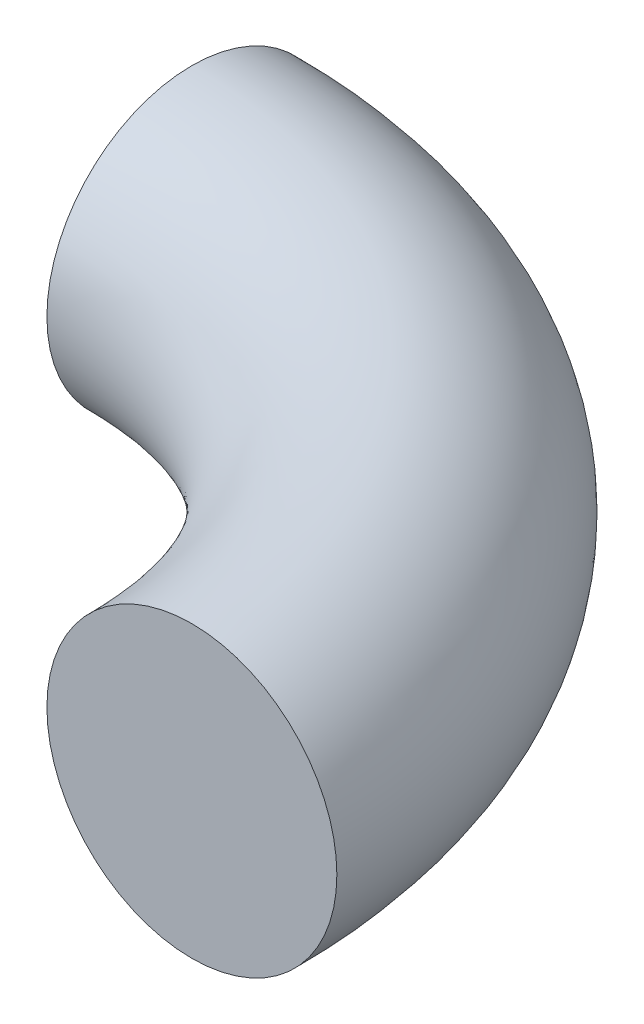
from build123d import *

# Parameters (mm, degrees)
SKETCH_7_R               = 30
CUT_EXTRUDE_2_DEPTH      = 187.279360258
CUT_EXTRUDE_2_DEPTH_BACK = 187.279360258


with BuildPart() as part:
    # Sweep 1: sweep along a path in Sketch 6
    with BuildLine(Plane(origin=(0, 0, 0), x_dir=(1, 0, 0), z_dir=(0, 1, 0))) as sweep_1_path:
        CenterArc((0, 0), 100, 0, 360)
    # Sketch 7 → Sweep 1 (sweep)
    with BuildSketch(Plane.XY):
        with Locations((100, 0)):
            Circle(SKETCH_7_R)
    sweep(path=sweep_1_path.line)

    # Sketch 9 → Cut-Extrude 2 (cut, two sides: drawn at the far end of the back side and taken through both)
    with BuildSketch(Plane(origin=(0, 0, 0), x_dir=(1, 0, 0), z_dir=(0, 1, 0)).offset(-CUT_EXTRUDE_2_DEPTH_BACK)):
        Polygon((0, 792.557056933), (0, 155.375500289), (0, 0), (147.976666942, 0), (785.158223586, 0), (-120.168458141, -896.875099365), (-905.326681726, -104.318042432), align=None)
    extrude(amount=CUT_EXTRUDE_2_DEPTH + CUT_EXTRUDE_2_DEPTH_BACK, mode=Mode.SUBTRACT)


solid = part.part
